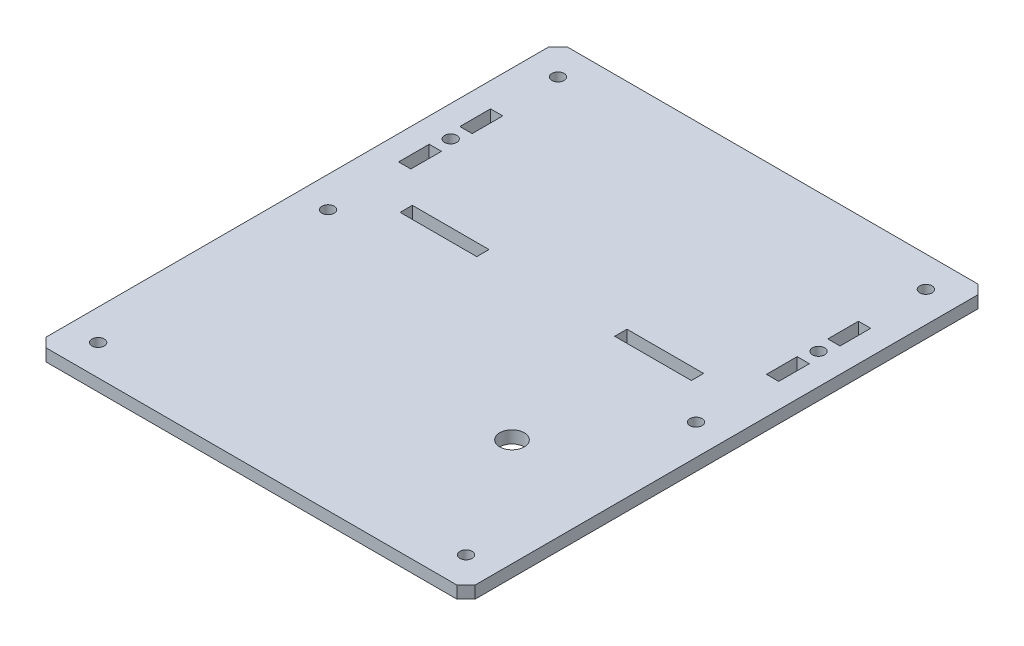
ISO-10303-21;
HEADER;
FILE_DESCRIPTION(('STEP AP214'),'2;1');
FILE_NAME('part.step','',(''),(''),'','','');
FILE_SCHEMA(('AUTOMOTIVE_DESIGN { 1 0 10303 214 1 1 1 1 }'));
ENDSEC;
DATA;
#1=APPLICATION_CONTEXT('core data for automotive mechanical design processes');
#2=APPLICATION_PROTOCOL_DEFINITION('international standard','automotive_design',2000,#1);
#3=PRODUCT_CONTEXT('',#1,'mechanical');
#4=PRODUCT('Part','Part','',(#3));
#5=PRODUCT_RELATED_PRODUCT_CATEGORY('part','',(#4));
#6=PRODUCT_DEFINITION_FORMATION('','',#4);
#7=PRODUCT_DEFINITION_CONTEXT('part definition',#1,'design');
#8=PRODUCT_DEFINITION('design','',#6,#7);
#9=PRODUCT_DEFINITION_SHAPE('','',#8);
#10=(LENGTH_UNIT() NAMED_UNIT(*) SI_UNIT(.MILLI.,.METRE.));
#11=(NAMED_UNIT(*) PLANE_ANGLE_UNIT() SI_UNIT($,.RADIAN.));
#12=(NAMED_UNIT(*) SI_UNIT($,.STERADIAN.) SOLID_ANGLE_UNIT());
#13=UNCERTAINTY_MEASURE_WITH_UNIT(LENGTH_MEASURE(1.E-05),#10,'distance_accuracy_value','');
#14=(GEOMETRIC_REPRESENTATION_CONTEXT(3) GLOBAL_UNCERTAINTY_ASSIGNED_CONTEXT((#13)) GLOBAL_UNIT_ASSIGNED_CONTEXT((#10,
#11,#12)) REPRESENTATION_CONTEXT('',''));
#15=CARTESIAN_POINT('',(0.,0.,0.));
#16=DIRECTION('',(0.,0.,1.));
#17=DIRECTION('',(1.,0.,0.));
#18=AXIS2_PLACEMENT_3D('',#15,#16,#17);
#19=CARTESIAN_POINT('',(-70.,-4.,82.));
#20=DIRECTION('',(-1.,0.,0.));
#21=DIRECTION('',(0.,0.,1.));
#22=AXIS2_PLACEMENT_3D('',#19,#20,#21);
#23=PLANE('',#22);
#24=DIRECTION('',(0.,0.,1.));
#25=VECTOR('',#24,1.);
#26=CARTESIAN_POINT('',(-70.,0.,82.));
#27=LINE('',#26,#25);
#28=CARTESIAN_POINT('',(-70.,0.,-82.));
#29=VERTEX_POINT('',#28);
#30=CARTESIAN_POINT('',(-70.,0.,82.));
#31=VERTEX_POINT('',#30);
#32=EDGE_CURVE('E435',#29,#31,#27,.T.);
#33=ORIENTED_EDGE('',*,*,#32,.F.);
#34=DIRECTION('',(0.,1.,0.));
#35=VECTOR('',#34,1.);
#36=CARTESIAN_POINT('',(-70.,-4.,-82.));
#37=LINE('',#36,#35);
#38=CARTESIAN_POINT('',(-70.,-4.,-82.));
#39=VERTEX_POINT('',#38);
#40=EDGE_CURVE('E459',#39,#29,#37,.T.);
#41=ORIENTED_EDGE('',*,*,#40,.F.);
#42=DIRECTION('',(0.,0.,1.));
#43=VECTOR('',#42,1.);
#44=CARTESIAN_POINT('',(-70.,-4.,82.));
#45=LINE('',#44,#43);
#46=CARTESIAN_POINT('',(-70.,-4.,82.));
#47=VERTEX_POINT('',#46);
#48=EDGE_CURVE('E409',#39,#47,#45,.T.);
#49=ORIENTED_EDGE('',*,*,#48,.T.);
#50=DIRECTION('',(0.,1.,0.));
#51=VECTOR('',#50,1.);
#52=CARTESIAN_POINT('',(-70.,-4.,82.));
#53=LINE('',#52,#51);
#54=EDGE_CURVE('E434',#47,#31,#53,.T.);
#55=ORIENTED_EDGE('',*,*,#54,.T.);
#56=EDGE_LOOP('',(#33,#41,#49,#55));
#57=FACE_BOUND('',#56,.T.);
#58=ADVANCED_FACE('F40',(#57),#23,.T.);
#59=CARTESIAN_POINT('',(-70.,-4.,-82.));
#60=DIRECTION('',(-0.707106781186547,0.,-0.707106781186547));
#61=DIRECTION('',(-0.707106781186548,0.,0.707106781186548));
#62=AXIS2_PLACEMENT_3D('',#59,#60,#61);
#63=PLANE('',#62);
#64=DIRECTION('',(-0.707106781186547,0.,0.707106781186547));
#65=VECTOR('',#64,1.);
#66=CARTESIAN_POINT('',(-70.,0.,-82.));
#67=LINE('',#66,#65);
#68=CARTESIAN_POINT('',(-67.,0.,-85.));
#69=VERTEX_POINT('',#68);
#70=EDGE_CURVE('E413',#69,#29,#67,.T.);
#71=ORIENTED_EDGE('',*,*,#70,.F.);
#72=DIRECTION('',(0.,1.,0.));
#73=VECTOR('',#72,1.);
#74=CARTESIAN_POINT('',(-67.,-4.,-85.));
#75=LINE('',#74,#73);
#76=CARTESIAN_POINT('',(-67.,-4.,-85.));
#77=VERTEX_POINT('',#76);
#78=EDGE_CURVE('E462',#77,#69,#75,.T.);
#79=ORIENTED_EDGE('',*,*,#78,.F.);
#80=DIRECTION('',(-0.707106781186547,0.,0.707106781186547));
#81=VECTOR('',#80,1.);
#82=CARTESIAN_POINT('',(-70.,-4.,-82.));
#83=LINE('',#82,#81);
#84=EDGE_CURVE('E431',#77,#39,#83,.T.);
#85=ORIENTED_EDGE('',*,*,#84,.T.);
#86=ORIENTED_EDGE('',*,*,#40,.T.);
#87=EDGE_LOOP('',(#71,#79,#85,#86));
#88=FACE_BOUND('',#87,.T.);
#89=ADVANCED_FACE('F587',(#88),#63,.T.);
#90=CARTESIAN_POINT('',(-67.,-4.,-85.));
#91=DIRECTION('',(0.,0.,-1.));
#92=DIRECTION('',(-1.,0.,0.));
#93=AXIS2_PLACEMENT_3D('',#90,#91,#92);
#94=PLANE('',#93);
#95=DIRECTION('',(-1.,0.,0.));
#96=VECTOR('',#95,1.);
#97=CARTESIAN_POINT('',(-67.,0.,-85.));
#98=LINE('',#97,#96);
#99=CARTESIAN_POINT('',(67.,0.,-85.));
#100=VERTEX_POINT('',#99);
#101=EDGE_CURVE('E454',#100,#69,#98,.T.);
#102=ORIENTED_EDGE('',*,*,#101,.F.);
#103=DIRECTION('',(0.,1.,0.));
#104=VECTOR('',#103,1.);
#105=CARTESIAN_POINT('',(67.,-4.,-85.));
#106=LINE('',#105,#104);
#107=CARTESIAN_POINT('',(67.,-4.,-85.));
#108=VERTEX_POINT('',#107);
#109=EDGE_CURVE('E464',#108,#100,#106,.T.);
#110=ORIENTED_EDGE('',*,*,#109,.F.);
#111=DIRECTION('',(-1.,0.,0.));
#112=VECTOR('',#111,1.);
#113=CARTESIAN_POINT('',(-67.,-4.,-85.));
#114=LINE('',#113,#112);
#115=EDGE_CURVE('E428',#108,#77,#114,.T.);
#116=ORIENTED_EDGE('',*,*,#115,.T.);
#117=ORIENTED_EDGE('',*,*,#78,.T.);
#118=EDGE_LOOP('',(#102,#110,#116,#117));
#119=FACE_BOUND('',#118,.T.);
#120=ADVANCED_FACE('F592',(#119),#94,.T.);
#121=CARTESIAN_POINT('',(67.,-4.,-85.));
#122=DIRECTION('',(0.707106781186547,0.,-0.707106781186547));
#123=DIRECTION('',(-0.707106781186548,0.,-0.707106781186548));
#124=AXIS2_PLACEMENT_3D('',#121,#122,#123);
#125=PLANE('',#124);
#126=DIRECTION('',(-0.707106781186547,0.,-0.707106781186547));
#127=VECTOR('',#126,1.);
#128=CARTESIAN_POINT('',(67.,0.,-85.));
#129=LINE('',#128,#127);
#130=CARTESIAN_POINT('',(70.,0.,-82.));
#131=VERTEX_POINT('',#130);
#132=EDGE_CURVE('E451',#131,#100,#129,.T.);
#133=ORIENTED_EDGE('',*,*,#132,.F.);
#134=DIRECTION('',(0.,1.,0.));
#135=VECTOR('',#134,1.);
#136=CARTESIAN_POINT('',(70.,-4.,-82.));
#137=LINE('',#136,#135);
#138=CARTESIAN_POINT('',(70.,-4.,-82.));
#139=VERTEX_POINT('',#138);
#140=EDGE_CURVE('E466',#139,#131,#137,.T.);
#141=ORIENTED_EDGE('',*,*,#140,.F.);
#142=DIRECTION('',(-0.707106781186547,0.,-0.707106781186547));
#143=VECTOR('',#142,1.);
#144=CARTESIAN_POINT('',(67.,-4.,-85.));
#145=LINE('',#144,#143);
#146=EDGE_CURVE('E425',#139,#108,#145,.T.);
#147=ORIENTED_EDGE('',*,*,#146,.T.);
#148=ORIENTED_EDGE('',*,*,#109,.T.);
#149=EDGE_LOOP('',(#133,#141,#147,#148));
#150=FACE_BOUND('',#149,.T.);
#151=ADVANCED_FACE('F622',(#150),#125,.T.);
#152=CARTESIAN_POINT('',(70.,-4.,82.));
#153=DIRECTION('',(1.,0.,0.));
#154=DIRECTION('',(0.,0.,-1.));
#155=AXIS2_PLACEMENT_3D('',#152,#153,#154);
#156=PLANE('',#155);
#157=DIRECTION('',(0.,0.,-1.));
#158=VECTOR('',#157,1.);
#159=CARTESIAN_POINT('',(70.,0.,82.));
#160=LINE('',#159,#158);
#161=CARTESIAN_POINT('',(70.,0.,82.));
#162=VERTEX_POINT('',#161);
#163=EDGE_CURVE('E448',#162,#131,#160,.T.);
#164=ORIENTED_EDGE('',*,*,#163,.F.);
#165=DIRECTION('',(0.,1.,0.));
#166=VECTOR('',#165,1.);
#167=CARTESIAN_POINT('',(70.,-4.,82.));
#168=LINE('',#167,#166);
#169=CARTESIAN_POINT('',(70.,-4.,82.));
#170=VERTEX_POINT('',#169);
#171=EDGE_CURVE('E468',#170,#162,#168,.T.);
#172=ORIENTED_EDGE('',*,*,#171,.F.);
#173=DIRECTION('',(0.,0.,-1.));
#174=VECTOR('',#173,1.);
#175=CARTESIAN_POINT('',(70.,-4.,82.));
#176=LINE('',#175,#174);
#177=EDGE_CURVE('E422',#170,#139,#176,.T.);
#178=ORIENTED_EDGE('',*,*,#177,.T.);
#179=ORIENTED_EDGE('',*,*,#140,.T.);
#180=EDGE_LOOP('',(#164,#172,#178,#179));
#181=FACE_BOUND('',#180,.T.);
#182=ADVANCED_FACE('F619',(#181),#156,.T.);
#183=CARTESIAN_POINT('',(67.,-4.,85.));
#184=DIRECTION('',(0.707106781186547,0.,0.707106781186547));
#185=DIRECTION('',(0.707106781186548,0.,-0.707106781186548));
#186=AXIS2_PLACEMENT_3D('',#183,#184,#185);
#187=PLANE('',#186);
#188=DIRECTION('',(0.707106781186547,0.,-0.707106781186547));
#189=VECTOR('',#188,1.);
#190=CARTESIAN_POINT('',(67.,0.,85.));
#191=LINE('',#190,#189);
#192=CARTESIAN_POINT('',(67.,0.,85.));
#193=VERTEX_POINT('',#192);
#194=EDGE_CURVE('E445',#193,#162,#191,.T.);
#195=ORIENTED_EDGE('',*,*,#194,.F.);
#196=DIRECTION('',(0.,1.,0.));
#197=VECTOR('',#196,1.);
#198=CARTESIAN_POINT('',(67.,-4.,85.));
#199=LINE('',#198,#197);
#200=CARTESIAN_POINT('',(67.,-4.,85.));
#201=VERTEX_POINT('',#200);
#202=EDGE_CURVE('E470',#201,#193,#199,.T.);
#203=ORIENTED_EDGE('',*,*,#202,.F.);
#204=DIRECTION('',(0.707106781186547,0.,-0.707106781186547));
#205=VECTOR('',#204,1.);
#206=CARTESIAN_POINT('',(67.,-4.,85.));
#207=LINE('',#206,#205);
#208=EDGE_CURVE('E419',#201,#170,#207,.T.);
#209=ORIENTED_EDGE('',*,*,#208,.T.);
#210=ORIENTED_EDGE('',*,*,#171,.T.);
#211=EDGE_LOOP('',(#195,#203,#209,#210));
#212=FACE_BOUND('',#211,.T.);
#213=ADVANCED_FACE('F615',(#212),#187,.T.);
#214=CARTESIAN_POINT('',(-67.,-4.,85.));
#215=DIRECTION('',(0.,0.,1.));
#216=DIRECTION('',(1.,0.,0.));
#217=AXIS2_PLACEMENT_3D('',#214,#215,#216);
#218=PLANE('',#217);
#219=DIRECTION('',(1.,0.,0.));
#220=VECTOR('',#219,1.);
#221=CARTESIAN_POINT('',(-67.,0.,85.));
#222=LINE('',#221,#220);
#223=CARTESIAN_POINT('',(-67.,0.,85.));
#224=VERTEX_POINT('',#223);
#225=EDGE_CURVE('E442',#224,#193,#222,.T.);
#226=ORIENTED_EDGE('',*,*,#225,.F.);
#227=DIRECTION('',(0.,1.,0.));
#228=VECTOR('',#227,1.);
#229=CARTESIAN_POINT('',(-67.,-4.,85.));
#230=LINE('',#229,#228);
#231=CARTESIAN_POINT('',(-67.,-4.,85.));
#232=VERTEX_POINT('',#231);
#233=EDGE_CURVE('E472',#232,#224,#230,.T.);
#234=ORIENTED_EDGE('',*,*,#233,.F.);
#235=DIRECTION('',(1.,0.,0.));
#236=VECTOR('',#235,1.);
#237=CARTESIAN_POINT('',(-67.,-4.,85.));
#238=LINE('',#237,#236);
#239=EDGE_CURVE('E416',#232,#201,#238,.T.);
#240=ORIENTED_EDGE('',*,*,#239,.T.);
#241=ORIENTED_EDGE('',*,*,#202,.T.);
#242=EDGE_LOOP('',(#226,#234,#240,#241));
#243=FACE_BOUND('',#242,.T.);
#244=ADVANCED_FACE('F613',(#243),#218,.T.);
#245=CARTESIAN_POINT('',(-70.,-4.,82.));
#246=DIRECTION('',(-0.707106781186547,0.,0.707106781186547));
#247=DIRECTION('',(0.707106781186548,0.,0.707106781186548));
#248=AXIS2_PLACEMENT_3D('',#245,#246,#247);
#249=PLANE('',#248);
#250=DIRECTION('',(0.707106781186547,0.,0.707106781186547));
#251=VECTOR('',#250,1.);
#252=CARTESIAN_POINT('',(-70.,0.,82.));
#253=LINE('',#252,#251);
#254=EDGE_CURVE('E438',#31,#224,#253,.T.);
#255=ORIENTED_EDGE('',*,*,#254,.F.);
#256=ORIENTED_EDGE('',*,*,#54,.F.);
#257=DIRECTION('',(0.707106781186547,0.,0.707106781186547));
#258=VECTOR('',#257,1.);
#259=CARTESIAN_POINT('',(-70.,-4.,82.));
#260=LINE('',#259,#258);
#261=EDGE_CURVE('E412',#47,#232,#260,.T.);
#262=ORIENTED_EDGE('',*,*,#261,.T.);
#263=ORIENTED_EDGE('',*,*,#233,.T.);
#264=EDGE_LOOP('',(#255,#256,#262,#263));
#265=FACE_BOUND('',#264,.T.);
#266=ADVANCED_FACE('F609',(#265),#249,.T.);
#267=CARTESIAN_POINT('',(0.,-4.,0.));
#268=DIRECTION('',(0.,-1.,0.));
#269=DIRECTION('',(0.,0.,-1.));
#270=AXIS2_PLACEMENT_3D('',#267,#268,#269);
#271=PLANE('',#270);
#272=DIRECTION('',(0.,0.,-1.));
#273=VECTOR('',#272,1.);
#274=CARTESIAN_POINT('',(61.9999999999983,-4.,-55.));
#275=LINE('',#274,#273);
#276=CARTESIAN_POINT('',(61.9999999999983,-4.,-45.));
#277=VERTEX_POINT('',#276);
#278=CARTESIAN_POINT('',(61.9999999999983,-4.,-55.));
#279=VERTEX_POINT('',#278);
#280=EDGE_CURVE('E327',#277,#279,#275,.T.);
#281=ORIENTED_EDGE('',*,*,#280,.T.);
#282=DIRECTION('',(-1.,0.,0.));
#283=VECTOR('',#282,1.);
#284=CARTESIAN_POINT('',(61.9999999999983,-4.,-55.));
#285=LINE('',#284,#283);
#286=CARTESIAN_POINT('',(57.9999999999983,-4.,-55.));
#287=VERTEX_POINT('',#286);
#288=EDGE_CURVE('E349',#279,#287,#285,.T.);
#289=ORIENTED_EDGE('',*,*,#288,.T.);
#290=DIRECTION('',(0.,0.,1.));
#291=VECTOR('',#290,1.);
#292=CARTESIAN_POINT('',(57.9999999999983,-4.,-55.));
#293=LINE('',#292,#291);
#294=CARTESIAN_POINT('',(57.9999999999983,-4.,-45.));
#295=VERTEX_POINT('',#294);
#296=EDGE_CURVE('E54',#287,#295,#293,.T.);
#297=ORIENTED_EDGE('',*,*,#296,.T.);
#298=DIRECTION('',(1.,0.,0.));
#299=VECTOR('',#298,1.);
#300=CARTESIAN_POINT('',(61.9999999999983,-4.,-45.));
#301=LINE('',#300,#299);
#302=EDGE_CURVE('E338',#295,#277,#301,.T.);
#303=ORIENTED_EDGE('',*,*,#302,.T.);
#304=EDGE_LOOP('',(#281,#289,#297,#303));
#305=FACE_BOUND('',#304,.T.);
#306=DIRECTION('',(0.,0.,-1.));
#307=VECTOR('',#306,1.);
#308=CARTESIAN_POINT('',(-58.,-4.,-55.));
#309=LINE('',#308,#307);
#310=CARTESIAN_POINT('',(-58.0000000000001,-4.,-45.));
#311=VERTEX_POINT('',#310);
#312=CARTESIAN_POINT('',(-58.,-4.,-55.));
#313=VERTEX_POINT('',#312);
#314=EDGE_CURVE('E315',#311,#313,#309,.T.);
#315=ORIENTED_EDGE('',*,*,#314,.T.);
#316=DIRECTION('',(-1.,0.,0.));
#317=VECTOR('',#316,1.);
#318=CARTESIAN_POINT('',(-62.0000000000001,-4.,-55.));
#319=LINE('',#318,#317);
#320=CARTESIAN_POINT('',(-62.0000000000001,-4.,-55.));
#321=VERTEX_POINT('',#320);
#322=EDGE_CURVE('E331',#313,#321,#319,.T.);
#323=ORIENTED_EDGE('',*,*,#322,.T.);
#324=DIRECTION('',(0.,0.,1.));
#325=VECTOR('',#324,1.);
#326=CARTESIAN_POINT('',(-62.0000000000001,-4.,-55.));
#327=LINE('',#326,#325);
#328=CARTESIAN_POINT('',(-62.0000000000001,-4.,-45.));
#329=VERTEX_POINT('',#328);
#330=EDGE_CURVE('E62',#321,#329,#327,.T.);
#331=ORIENTED_EDGE('',*,*,#330,.T.);
#332=DIRECTION('',(1.,0.,0.));
#333=VECTOR('',#332,1.);
#334=CARTESIAN_POINT('',(-62.0000000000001,-4.,-45.));
#335=LINE('',#334,#333);
#336=EDGE_CURVE('E318',#329,#311,#335,.T.);
#337=ORIENTED_EDGE('',*,*,#336,.T.);
#338=EDGE_LOOP('',(#315,#323,#331,#337));
#339=FACE_BOUND('',#338,.T.);
#340=CARTESIAN_POINT('',(-59.9999999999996,-4.,-40.0000000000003));
#341=DIRECTION('',(0.,1.,0.));
#342=DIRECTION('',(0.,0.,1.));
#343=AXIS2_PLACEMENT_3D('',#340,#341,#342);
#344=CIRCLE('',#343,1.99999999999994);
#345=CARTESIAN_POINT('',(-59.9999999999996,-4.,-38.0000000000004));
#346=VERTEX_POINT('',#345);
#347=EDGE_CURVE('E312',#346,#346,#344,.T.);
#348=ORIENTED_EDGE('',*,*,#347,.T.);
#349=EDGE_LOOP('',(#348));
#350=FACE_BOUND('',#349,.T.);
#351=CARTESIAN_POINT('',(-59.9999999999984,-4.,75.));
#352=DIRECTION('',(0.,1.,0.));
#353=DIRECTION('',(0.,0.,1.));
#354=AXIS2_PLACEMENT_3D('',#351,#352,#353);
#355=CIRCLE('',#354,2.);
#356=CARTESIAN_POINT('',(-59.9999999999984,-4.,77.));
#357=VERTEX_POINT('',#356);
#358=EDGE_CURVE('E308',#357,#357,#355,.T.);
#359=ORIENTED_EDGE('',*,*,#358,.T.);
#360=EDGE_LOOP('',(#359));
#361=FACE_BOUND('',#360,.T.);
#362=DIRECTION('',(0.,0.,-1.));
#363=VECTOR('',#362,1.);
#364=CARTESIAN_POINT('',(-58.,-4.,-35.));
#365=LINE('',#364,#363);
#366=CARTESIAN_POINT('',(-58.,-4.,-25.));
#367=VERTEX_POINT('',#366);
#368=CARTESIAN_POINT('',(-58.,-4.,-35.));
#369=VERTEX_POINT('',#368);
#370=EDGE_CURVE('E380',#367,#369,#365,.T.);
#371=ORIENTED_EDGE('',*,*,#370,.T.);
#372=DIRECTION('',(-1.,0.,0.));
#373=VECTOR('',#372,1.);
#374=CARTESIAN_POINT('',(-62.,-4.,-35.));
#375=LINE('',#374,#373);
#376=CARTESIAN_POINT('',(-62.,-4.,-35.));
#377=VERTEX_POINT('',#376);
#378=EDGE_CURVE('E377',#369,#377,#375,.T.);
#379=ORIENTED_EDGE('',*,*,#378,.T.);
#380=DIRECTION('',(0.,0.,1.));
#381=VECTOR('',#380,1.);
#382=CARTESIAN_POINT('',(-62.,-4.,-35.));
#383=LINE('',#382,#381);
#384=CARTESIAN_POINT('',(-62.,-4.,-25.));
#385=VERTEX_POINT('',#384);
#386=EDGE_CURVE('E374',#377,#385,#383,.T.);
#387=ORIENTED_EDGE('',*,*,#386,.T.);
#388=DIRECTION('',(1.,0.,0.));
#389=VECTOR('',#388,1.);
#390=CARTESIAN_POINT('',(-62.,-4.,-25.));
#391=LINE('',#390,#389);
#392=EDGE_CURVE('E362',#385,#367,#391,.T.);
#393=ORIENTED_EDGE('',*,*,#392,.T.);
#394=EDGE_LOOP('',(#371,#379,#387,#393));
#395=FACE_BOUND('',#394,.T.);
#396=CARTESIAN_POINT('',(34.9999999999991,-4.,35.));
#397=DIRECTION('',(0.,1.,0.));
#398=DIRECTION('',(0.,0.,1.));
#399=AXIS2_PLACEMENT_3D('',#396,#397,#398);
#400=CIRCLE('',#399,4.00000000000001);
#401=CARTESIAN_POINT('',(34.9999999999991,-4.,39.));
#402=VERTEX_POINT('',#401);
#403=EDGE_CURVE('E357',#402,#402,#400,.T.);
#404=ORIENTED_EDGE('',*,*,#403,.T.);
#405=EDGE_LOOP('',(#404));
#406=FACE_BOUND('',#405,.T.);
#407=CARTESIAN_POINT('',(-60.,-4.,-75.));
#408=DIRECTION('',(0.,1.,0.));
#409=DIRECTION('',(0.,0.,1.));
#410=AXIS2_PLACEMENT_3D('',#407,#408,#409);
#411=CIRCLE('',#410,2.);
#412=CARTESIAN_POINT('',(-60.,-4.,-73.));
#413=VERTEX_POINT('',#412);
#414=EDGE_CURVE('E354',#413,#413,#411,.T.);
#415=ORIENTED_EDGE('',*,*,#414,.T.);
#416=EDGE_LOOP('',(#415));
#417=FACE_BOUND('',#416,.T.);
#418=CARTESIAN_POINT('',(-59.9999999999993,-4.,0.));
#419=DIRECTION('',(0.,1.,0.));
#420=DIRECTION('',(0.,0.,1.));
#421=AXIS2_PLACEMENT_3D('',#418,#419,#420);
#422=CIRCLE('',#421,2.);
#423=CARTESIAN_POINT('',(-59.9999999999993,-4.,2.));
#424=VERTEX_POINT('',#423);
#425=EDGE_CURVE('E311',#424,#424,#422,.T.);
#426=ORIENTED_EDGE('',*,*,#425,.T.);
#427=EDGE_LOOP('',(#426));
#428=FACE_BOUND('',#427,.T.);
#429=CARTESIAN_POINT('',(59.9999999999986,-4.,-75.0000000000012));
#430=DIRECTION('',(0.,1.,0.));
#431=DIRECTION('',(0.,0.,-1.));
#432=AXIS2_PLACEMENT_3D('',#429,#430,#431);
#433=CIRCLE('',#432,2.);
#434=CARTESIAN_POINT('',(59.9999999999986,-4.,-77.0000000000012));
#435=VERTEX_POINT('',#434);
#436=EDGE_CURVE('E1027',#435,#435,#433,.T.);
#437=ORIENTED_EDGE('',*,*,#436,.T.);
#438=EDGE_LOOP('',(#437));
#439=FACE_BOUND('',#438,.T.);
#440=CARTESIAN_POINT('',(59.9999999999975,-4.,0.));
#441=DIRECTION('',(0.,1.,0.));
#442=DIRECTION('',(0.,0.,-1.));
#443=AXIS2_PLACEMENT_3D('',#440,#441,#442);
#444=CIRCLE('',#443,1.99999999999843);
#445=CARTESIAN_POINT('',(59.9999999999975,-4.,-1.99999999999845));
#446=VERTEX_POINT('',#445);
#447=EDGE_CURVE('E1024',#446,#446,#444,.T.);
#448=ORIENTED_EDGE('',*,*,#447,.T.);
#449=EDGE_LOOP('',(#448));
#450=FACE_BOUND('',#449,.T.);
#451=DIRECTION('',(0.,0.,-1.));
#452=VECTOR('',#451,1.);
#453=CARTESIAN_POINT('',(61.9999999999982,-4.,-35.));
#454=LINE('',#453,#452);
#455=CARTESIAN_POINT('',(61.9999999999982,-4.,-25.));
#456=VERTEX_POINT('',#455);
#457=CARTESIAN_POINT('',(61.9999999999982,-4.,-35.));
#458=VERTEX_POINT('',#457);
#459=EDGE_CURVE('E266',#456,#458,#454,.T.);
#460=ORIENTED_EDGE('',*,*,#459,.T.);
#461=DIRECTION('',(-1.,0.,0.));
#462=VECTOR('',#461,1.);
#463=CARTESIAN_POINT('',(61.9999999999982,-4.,-35.));
#464=LINE('',#463,#462);
#465=CARTESIAN_POINT('',(57.9999999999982,-4.,-35.));
#466=VERTEX_POINT('',#465);
#467=EDGE_CURVE('E273',#458,#466,#464,.T.);
#468=ORIENTED_EDGE('',*,*,#467,.T.);
#469=DIRECTION('',(0.,0.,1.));
#470=VECTOR('',#469,1.);
#471=CARTESIAN_POINT('',(57.9999999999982,-4.,-35.));
#472=LINE('',#471,#470);
#473=CARTESIAN_POINT('',(57.9999999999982,-4.,-25.));
#474=VERTEX_POINT('',#473);
#475=EDGE_CURVE('E277',#466,#474,#472,.T.);
#476=ORIENTED_EDGE('',*,*,#475,.T.);
#477=DIRECTION('',(1.,0.,0.));
#478=VECTOR('',#477,1.);
#479=CARTESIAN_POINT('',(61.9999999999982,-4.,-25.));
#480=LINE('',#479,#478);
#481=EDGE_CURVE('E255',#474,#456,#480,.T.);
#482=ORIENTED_EDGE('',*,*,#481,.T.);
#483=EDGE_LOOP('',(#460,#468,#476,#482));
#484=FACE_BOUND('',#483,.T.);
#485=DIRECTION('',(0.,0.,-1.));
#486=VECTOR('',#485,1.);
#487=CARTESIAN_POINT('',(47.4999999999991,-4.,-15.));
#488=LINE('',#487,#486);
#489=CARTESIAN_POINT('',(47.4999999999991,-4.,-11.));
#490=VERTEX_POINT('',#489);
#491=CARTESIAN_POINT('',(47.4999999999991,-4.,-15.));
#492=VERTEX_POINT('',#491);
#493=EDGE_CURVE('E263',#490,#492,#488,.T.);
#494=ORIENTED_EDGE('',*,*,#493,.T.);
#495=DIRECTION('',(-1.,0.,0.));
#496=VECTOR('',#495,1.);
#497=CARTESIAN_POINT('',(47.4999999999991,-4.,-15.));
#498=LINE('',#497,#496);
#499=CARTESIAN_POINT('',(22.4999999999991,-4.,-15.));
#500=VERTEX_POINT('',#499);
#501=EDGE_CURVE('E303',#492,#500,#498,.T.);
#502=ORIENTED_EDGE('',*,*,#501,.T.);
#503=DIRECTION('',(0.,0.,1.));
#504=VECTOR('',#503,1.);
#505=CARTESIAN_POINT('',(22.4999999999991,-4.,-15.));
#506=LINE('',#505,#504);
#507=CARTESIAN_POINT('',(22.4999999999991,-4.,-11.));
#508=VERTEX_POINT('',#507);
#509=EDGE_CURVE('E300',#500,#508,#506,.T.);
#510=ORIENTED_EDGE('',*,*,#509,.T.);
#511=DIRECTION('',(1.,0.,0.));
#512=VECTOR('',#511,1.);
#513=CARTESIAN_POINT('',(47.4999999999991,-4.,-11.));
#514=LINE('',#513,#512);
#515=EDGE_CURVE('E287',#508,#490,#514,.T.);
#516=ORIENTED_EDGE('',*,*,#515,.T.);
#517=EDGE_LOOP('',(#494,#502,#510,#516));
#518=FACE_BOUND('',#517,.T.);
#519=CARTESIAN_POINT('',(59.9999999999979,-4.,-40.0000000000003));
#520=DIRECTION('',(0.,1.,0.));
#521=DIRECTION('',(0.,0.,-1.));
#522=AXIS2_PLACEMENT_3D('',#519,#520,#521);
#523=CIRCLE('',#522,1.99999999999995);
#524=CARTESIAN_POINT('',(59.9999999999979,-4.,-42.0000000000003));
#525=VERTEX_POINT('',#524);
#526=EDGE_CURVE('E297',#525,#525,#523,.T.);
#527=ORIENTED_EDGE('',*,*,#526,.T.);
#528=EDGE_LOOP('',(#527));
#529=FACE_BOUND('',#528,.T.);
#530=CARTESIAN_POINT('',(59.9999999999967,-4.,75.));
#531=DIRECTION('',(0.,1.,0.));
#532=DIRECTION('',(0.,0.,-1.));
#533=AXIS2_PLACEMENT_3D('',#530,#531,#532);
#534=CIRCLE('',#533,1.99999999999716);
#535=CARTESIAN_POINT('',(59.9999999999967,-4.,73.0000000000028));
#536=VERTEX_POINT('',#535);
#537=EDGE_CURVE('E1026',#536,#536,#534,.T.);
#538=ORIENTED_EDGE('',*,*,#537,.T.);
#539=EDGE_LOOP('',(#538));
#540=FACE_BOUND('',#539,.T.);
#541=DIRECTION('',(0.,0.,-1.));
#542=VECTOR('',#541,1.);
#543=CARTESIAN_POINT('',(-22.5000000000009,-4.,-15.));
#544=LINE('',#543,#542);
#545=CARTESIAN_POINT('',(-22.5000000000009,-4.,-11.));
#546=VERTEX_POINT('',#545);
#547=CARTESIAN_POINT('',(-22.5000000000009,-4.,-15.));
#548=VERTEX_POINT('',#547);
#549=EDGE_CURVE('E383',#546,#548,#544,.T.);
#550=ORIENTED_EDGE('',*,*,#549,.T.);
#551=DIRECTION('',(-1.,0.,0.));
#552=VECTOR('',#551,1.);
#553=CARTESIAN_POINT('',(-47.5000000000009,-4.,-15.));
#554=LINE('',#553,#552);
#555=CARTESIAN_POINT('',(-47.5000000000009,-4.,-15.));
#556=VERTEX_POINT('',#555);
#557=EDGE_CURVE('E388',#548,#556,#554,.T.);
#558=ORIENTED_EDGE('',*,*,#557,.T.);
#559=DIRECTION('',(0.,0.,1.));
#560=VECTOR('',#559,1.);
#561=CARTESIAN_POINT('',(-47.5000000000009,-4.,-15.));
#562=LINE('',#561,#560);
#563=CARTESIAN_POINT('',(-47.5000000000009,-4.,-11.));
#564=VERTEX_POINT('',#563);
#565=EDGE_CURVE('E391',#556,#564,#562,.T.);
#566=ORIENTED_EDGE('',*,*,#565,.T.);
#567=DIRECTION('',(1.,0.,0.));
#568=VECTOR('',#567,1.);
#569=CARTESIAN_POINT('',(-47.5000000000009,-4.,-11.));
#570=LINE('',#569,#568);
#571=EDGE_CURVE('E394',#564,#546,#570,.T.);
#572=ORIENTED_EDGE('',*,*,#571,.T.);
#573=EDGE_LOOP('',(#550,#558,#566,#572));
#574=FACE_BOUND('',#573,.T.);
#575=ORIENTED_EDGE('',*,*,#48,.F.);
#576=ORIENTED_EDGE('',*,*,#84,.F.);
#577=ORIENTED_EDGE('',*,*,#115,.F.);
#578=ORIENTED_EDGE('',*,*,#146,.F.);
#579=ORIENTED_EDGE('',*,*,#177,.F.);
#580=ORIENTED_EDGE('',*,*,#208,.F.);
#581=ORIENTED_EDGE('',*,*,#239,.F.);
#582=ORIENTED_EDGE('',*,*,#261,.F.);
#583=EDGE_LOOP('',(#575,#576,#577,#578,#579,#580,#581,#582));
#584=FACE_BOUND('',#583,.T.);
#585=ADVANCED_FACE('F275',(#305,#339,#350,#361,#395,#406,#417,#428,#439,#450,#484,#518,#529,
#540,#574,#584),#271,.T.);
#586=CARTESIAN_POINT('',(0.,0.,0.));
#587=DIRECTION('',(0.,-1.,0.));
#588=DIRECTION('',(0.,0.,-1.));
#589=AXIS2_PLACEMENT_3D('',#586,#587,#588);
#590=PLANE('',#589);
#591=DIRECTION('',(1.,0.,0.));
#592=VECTOR('',#591,1.);
#593=CARTESIAN_POINT('',(0.,0.,-55.));
#594=LINE('',#593,#592);
#595=CARTESIAN_POINT('',(57.9999999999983,0.,-55.));
#596=VERTEX_POINT('',#595);
#597=CARTESIAN_POINT('',(61.9999999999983,0.,-55.));
#598=VERTEX_POINT('',#597);
#599=EDGE_CURVE('E556',#596,#598,#594,.T.);
#600=ORIENTED_EDGE('',*,*,#599,.T.);
#601=DIRECTION('',(0.,0.,1.));
#602=VECTOR('',#601,1.);
#603=CARTESIAN_POINT('',(61.9999999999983,0.,0.));
#604=LINE('',#603,#602);
#605=CARTESIAN_POINT('',(61.9999999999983,0.,-45.));
#606=VERTEX_POINT('',#605);
#607=EDGE_CURVE('E11',#598,#606,#604,.T.);
#608=ORIENTED_EDGE('',*,*,#607,.T.);
#609=DIRECTION('',(-1.,0.,0.));
#610=VECTOR('',#609,1.);
#611=CARTESIAN_POINT('',(0.,0.,-45.));
#612=LINE('',#611,#610);
#613=CARTESIAN_POINT('',(57.9999999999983,0.,-45.));
#614=VERTEX_POINT('',#613);
#615=EDGE_CURVE('E47',#606,#614,#612,.T.);
#616=ORIENTED_EDGE('',*,*,#615,.T.);
#617=DIRECTION('',(0.,0.,-1.));
#618=VECTOR('',#617,1.);
#619=CARTESIAN_POINT('',(57.9999999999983,0.,0.));
#620=LINE('',#619,#618);
#621=EDGE_CURVE('E559',#614,#596,#620,.T.);
#622=ORIENTED_EDGE('',*,*,#621,.T.);
#623=EDGE_LOOP('',(#600,#608,#616,#622));
#624=FACE_BOUND('',#623,.T.);
#625=DIRECTION('',(1.,0.,0.));
#626=VECTOR('',#625,1.);
#627=CARTESIAN_POINT('',(0.,0.,-55.));
#628=LINE('',#627,#626);
#629=CARTESIAN_POINT('',(-62.0000000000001,0.,-55.));
#630=VERTEX_POINT('',#629);
#631=CARTESIAN_POINT('',(-58.,0.,-55.));
#632=VERTEX_POINT('',#631);
#633=EDGE_CURVE('E540',#630,#632,#628,.T.);
#634=ORIENTED_EDGE('',*,*,#633,.T.);
#635=DIRECTION('',(0.,0.,1.));
#636=VECTOR('',#635,1.);
#637=CARTESIAN_POINT('',(-58.0000000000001,0.,0.));
#638=LINE('',#637,#636);
#639=CARTESIAN_POINT('',(-58.0000000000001,0.,-45.));
#640=VERTEX_POINT('',#639);
#641=EDGE_CURVE('E553',#632,#640,#638,.T.);
#642=ORIENTED_EDGE('',*,*,#641,.T.);
#643=DIRECTION('',(-1.,0.,0.));
#644=VECTOR('',#643,1.);
#645=CARTESIAN_POINT('',(0.,0.,-45.));
#646=LINE('',#645,#644);
#647=CARTESIAN_POINT('',(-62.0000000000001,0.,-45.));
#648=VERTEX_POINT('',#647);
#649=EDGE_CURVE('E550',#640,#648,#646,.T.);
#650=ORIENTED_EDGE('',*,*,#649,.T.);
#651=DIRECTION('',(0.,0.,-1.));
#652=VECTOR('',#651,1.);
#653=CARTESIAN_POINT('',(-62.,0.,0.));
#654=LINE('',#653,#652);
#655=EDGE_CURVE('E547',#648,#630,#654,.T.);
#656=ORIENTED_EDGE('',*,*,#655,.T.);
#657=EDGE_LOOP('',(#634,#642,#650,#656));
#658=FACE_BOUND('',#657,.T.);
#659=CARTESIAN_POINT('',(-59.9999999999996,0.,-40.0000000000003));
#660=DIRECTION('',(0.,-1.,0.));
#661=DIRECTION('',(0.,0.,-1.));
#662=AXIS2_PLACEMENT_3D('',#659,#660,#661);
#663=CIRCLE('',#662,1.99999999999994);
#664=CARTESIAN_POINT('',(-59.9999999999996,0.,-42.0000000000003));
#665=VERTEX_POINT('',#664);
#666=EDGE_CURVE('E439',#665,#665,#663,.T.);
#667=ORIENTED_EDGE('',*,*,#666,.T.);
#668=EDGE_LOOP('',(#667));
#669=FACE_BOUND('',#668,.T.);
#670=CARTESIAN_POINT('',(-59.9999999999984,0.,75.));
#671=DIRECTION('',(0.,-1.,0.));
#672=DIRECTION('',(0.,0.,-1.));
#673=AXIS2_PLACEMENT_3D('',#670,#671,#672);
#674=CIRCLE('',#673,2.);
#675=CARTESIAN_POINT('',(-59.9999999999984,0.,73.));
#676=VERTEX_POINT('',#675);
#677=EDGE_CURVE('E528',#676,#676,#674,.T.);
#678=ORIENTED_EDGE('',*,*,#677,.T.);
#679=EDGE_LOOP('',(#678));
#680=FACE_BOUND('',#679,.T.);
#681=DIRECTION('',(1.,0.,0.));
#682=VECTOR('',#681,1.);
#683=CARTESIAN_POINT('',(0.,0.,-35.));
#684=LINE('',#683,#682);
#685=CARTESIAN_POINT('',(-62.,0.,-35.));
#686=VERTEX_POINT('',#685);
#687=CARTESIAN_POINT('',(-58.,0.,-35.));
#688=VERTEX_POINT('',#687);
#689=EDGE_CURVE('E513',#686,#688,#684,.T.);
#690=ORIENTED_EDGE('',*,*,#689,.T.);
#691=DIRECTION('',(0.,0.,1.));
#692=VECTOR('',#691,1.);
#693=CARTESIAN_POINT('',(-58.,0.,0.));
#694=LINE('',#693,#692);
#695=CARTESIAN_POINT('',(-58.,0.,-25.));
#696=VERTEX_POINT('',#695);
#697=EDGE_CURVE('E537',#688,#696,#694,.T.);
#698=ORIENTED_EDGE('',*,*,#697,.T.);
#699=DIRECTION('',(-1.,0.,0.));
#700=VECTOR('',#699,1.);
#701=CARTESIAN_POINT('',(0.,0.,-25.));
#702=LINE('',#701,#700);
#703=CARTESIAN_POINT('',(-62.,0.,-25.));
#704=VERTEX_POINT('',#703);
#705=EDGE_CURVE('E534',#696,#704,#702,.T.);
#706=ORIENTED_EDGE('',*,*,#705,.T.);
#707=DIRECTION('',(0.,0.,-1.));
#708=VECTOR('',#707,1.);
#709=CARTESIAN_POINT('',(-62.,0.,0.));
#710=LINE('',#709,#708);
#711=EDGE_CURVE('E531',#704,#686,#710,.T.);
#712=ORIENTED_EDGE('',*,*,#711,.T.);
#713=EDGE_LOOP('',(#690,#698,#706,#712));
#714=FACE_BOUND('',#713,.T.);
#715=CARTESIAN_POINT('',(34.9999999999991,0.,35.));
#716=DIRECTION('',(0.,-1.,0.));
#717=DIRECTION('',(0.,0.,-1.));
#718=AXIS2_PLACEMENT_3D('',#715,#716,#717);
#719=CIRCLE('',#718,4.00000000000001);
#720=CARTESIAN_POINT('',(34.9999999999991,0.,31.));
#721=VERTEX_POINT('',#720);
#722=EDGE_CURVE('E525',#721,#721,#719,.T.);
#723=ORIENTED_EDGE('',*,*,#722,.T.);
#724=EDGE_LOOP('',(#723));
#725=FACE_BOUND('',#724,.T.);
#726=CARTESIAN_POINT('',(-60.,0.,-75.));
#727=DIRECTION('',(0.,-1.,0.));
#728=DIRECTION('',(0.,0.,-1.));
#729=AXIS2_PLACEMENT_3D('',#726,#727,#728);
#730=CIRCLE('',#729,2.);
#731=CARTESIAN_POINT('',(-60.,0.,-77.));
#732=VERTEX_POINT('',#731);
#733=EDGE_CURVE('E522',#732,#732,#730,.T.);
#734=ORIENTED_EDGE('',*,*,#733,.T.);
#735=EDGE_LOOP('',(#734));
#736=FACE_BOUND('',#735,.T.);
#737=CARTESIAN_POINT('',(-59.9999999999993,0.,0.));
#738=DIRECTION('',(0.,-1.,0.));
#739=DIRECTION('',(0.,0.,-1.));
#740=AXIS2_PLACEMENT_3D('',#737,#738,#739);
#741=CIRCLE('',#740,2.);
#742=CARTESIAN_POINT('',(-59.9999999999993,0.,-2.));
#743=VERTEX_POINT('',#742);
#744=EDGE_CURVE('E519',#743,#743,#741,.T.);
#745=ORIENTED_EDGE('',*,*,#744,.T.);
#746=EDGE_LOOP('',(#745));
#747=FACE_BOUND('',#746,.T.);
#748=CARTESIAN_POINT('',(59.9999999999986,0.,-75.0000000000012));
#749=DIRECTION('',(0.,-1.,0.));
#750=DIRECTION('',(0.,0.,-1.));
#751=AXIS2_PLACEMENT_3D('',#748,#749,#750);
#752=CIRCLE('',#751,2.);
#753=CARTESIAN_POINT('',(59.9999999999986,0.,-77.0000000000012));
#754=VERTEX_POINT('',#753);
#755=EDGE_CURVE('E516',#754,#754,#752,.T.);
#756=ORIENTED_EDGE('',*,*,#755,.T.);
#757=EDGE_LOOP('',(#756));
#758=FACE_BOUND('',#757,.T.);
#759=CARTESIAN_POINT('',(59.9999999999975,0.,0.));
#760=DIRECTION('',(0.,-1.,0.));
#761=DIRECTION('',(0.,0.,-1.));
#762=AXIS2_PLACEMENT_3D('',#759,#760,#761);
#763=CIRCLE('',#762,1.99999999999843);
#764=CARTESIAN_POINT('',(59.9999999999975,0.,-1.99999999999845));
#765=VERTEX_POINT('',#764);
#766=EDGE_CURVE('E492',#765,#765,#763,.T.);
#767=ORIENTED_EDGE('',*,*,#766,.T.);
#768=EDGE_LOOP('',(#767));
#769=FACE_BOUND('',#768,.T.);
#770=DIRECTION('',(1.,0.,0.));
#771=VECTOR('',#770,1.);
#772=CARTESIAN_POINT('',(0.,0.,-35.));
#773=LINE('',#772,#771);
#774=CARTESIAN_POINT('',(57.9999999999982,0.,-35.));
#775=VERTEX_POINT('',#774);
#776=CARTESIAN_POINT('',(61.9999999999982,0.,-35.));
#777=VERTEX_POINT('',#776);
#778=EDGE_CURVE('E504',#775,#777,#773,.T.);
#779=ORIENTED_EDGE('',*,*,#778,.T.);
#780=DIRECTION('',(0.,0.,1.));
#781=VECTOR('',#780,1.);
#782=CARTESIAN_POINT('',(61.9999999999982,0.,0.));
#783=LINE('',#782,#781);
#784=CARTESIAN_POINT('',(61.9999999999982,0.,-25.));
#785=VERTEX_POINT('',#784);
#786=EDGE_CURVE('E511',#777,#785,#783,.T.);
#787=ORIENTED_EDGE('',*,*,#786,.T.);
#788=DIRECTION('',(-1.,0.,0.));
#789=VECTOR('',#788,1.);
#790=CARTESIAN_POINT('',(0.,0.,-25.));
#791=LINE('',#790,#789);
#792=CARTESIAN_POINT('',(57.9999999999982,0.,-25.));
#793=VERTEX_POINT('',#792);
#794=EDGE_CURVE('E258',#785,#793,#791,.T.);
#795=ORIENTED_EDGE('',*,*,#794,.T.);
#796=DIRECTION('',(0.,0.,-1.));
#797=VECTOR('',#796,1.);
#798=CARTESIAN_POINT('',(57.9999999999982,0.,0.));
#799=LINE('',#798,#797);
#800=EDGE_CURVE('E507',#793,#775,#799,.T.);
#801=ORIENTED_EDGE('',*,*,#800,.T.);
#802=EDGE_LOOP('',(#779,#787,#795,#801));
#803=FACE_BOUND('',#802,.T.);
#804=DIRECTION('',(1.,0.,0.));
#805=VECTOR('',#804,1.);
#806=CARTESIAN_POINT('',(0.,0.,-15.));
#807=LINE('',#806,#805);
#808=CARTESIAN_POINT('',(22.4999999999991,0.,-15.));
#809=VERTEX_POINT('',#808);
#810=CARTESIAN_POINT('',(47.4999999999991,0.,-15.));
#811=VERTEX_POINT('',#810);
#812=EDGE_CURVE('E486',#809,#811,#807,.T.);
#813=ORIENTED_EDGE('',*,*,#812,.T.);
#814=DIRECTION('',(0.,0.,1.));
#815=VECTOR('',#814,1.);
#816=CARTESIAN_POINT('',(47.4999999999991,0.,0.));
#817=LINE('',#816,#815);
#818=CARTESIAN_POINT('',(47.4999999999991,0.,-11.));
#819=VERTEX_POINT('',#818);
#820=EDGE_CURVE('E501',#811,#819,#817,.T.);
#821=ORIENTED_EDGE('',*,*,#820,.T.);
#822=DIRECTION('',(-1.,0.,0.));
#823=VECTOR('',#822,1.);
#824=CARTESIAN_POINT('',(0.,0.,-11.));
#825=LINE('',#824,#823);
#826=CARTESIAN_POINT('',(22.4999999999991,0.,-11.));
#827=VERTEX_POINT('',#826);
#828=EDGE_CURVE('E498',#819,#827,#825,.T.);
#829=ORIENTED_EDGE('',*,*,#828,.T.);
#830=DIRECTION('',(0.,0.,-1.));
#831=VECTOR('',#830,1.);
#832=CARTESIAN_POINT('',(22.4999999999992,0.,0.));
#833=LINE('',#832,#831);
#834=EDGE_CURVE('E495',#827,#809,#833,.T.);
#835=ORIENTED_EDGE('',*,*,#834,.T.);
#836=EDGE_LOOP('',(#813,#821,#829,#835));
#837=FACE_BOUND('',#836,.T.);
#838=CARTESIAN_POINT('',(59.9999999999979,0.,-40.0000000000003));
#839=DIRECTION('',(0.,-1.,0.));
#840=DIRECTION('',(0.,0.,-1.));
#841=AXIS2_PLACEMENT_3D('',#838,#839,#840);
#842=CIRCLE('',#841,1.99999999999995);
#843=CARTESIAN_POINT('',(59.9999999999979,0.,-42.0000000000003));
#844=VERTEX_POINT('',#843);
#845=EDGE_CURVE('E489',#844,#844,#842,.T.);
#846=ORIENTED_EDGE('',*,*,#845,.T.);
#847=EDGE_LOOP('',(#846));
#848=FACE_BOUND('',#847,.T.);
#849=CARTESIAN_POINT('',(59.9999999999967,0.,75.));
#850=DIRECTION('',(0.,-1.,0.));
#851=DIRECTION('',(0.,0.,-1.));
#852=AXIS2_PLACEMENT_3D('',#849,#850,#851);
#853=CIRCLE('',#852,1.99999999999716);
#854=CARTESIAN_POINT('',(59.9999999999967,0.,73.0000000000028));
#855=VERTEX_POINT('',#854);
#856=EDGE_CURVE('E401',#855,#855,#853,.T.);
#857=ORIENTED_EDGE('',*,*,#856,.T.);
#858=EDGE_LOOP('',(#857));
#859=FACE_BOUND('',#858,.T.);
#860=DIRECTION('',(1.,0.,0.));
#861=VECTOR('',#860,1.);
#862=CARTESIAN_POINT('',(0.,0.,-15.));
#863=LINE('',#862,#861);
#864=CARTESIAN_POINT('',(-47.5000000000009,0.,-15.));
#865=VERTEX_POINT('',#864);
#866=CARTESIAN_POINT('',(-22.5000000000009,0.,-15.));
#867=VERTEX_POINT('',#866);
#868=EDGE_CURVE('E461',#865,#867,#863,.T.);
#869=ORIENTED_EDGE('',*,*,#868,.T.);
#870=DIRECTION('',(0.,0.,1.));
#871=VECTOR('',#870,1.);
#872=CARTESIAN_POINT('',(-22.5000000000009,0.,0.));
#873=LINE('',#872,#871);
#874=CARTESIAN_POINT('',(-22.5000000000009,0.,-11.));
#875=VERTEX_POINT('',#874);
#876=EDGE_CURVE('E483',#867,#875,#873,.T.);
#877=ORIENTED_EDGE('',*,*,#876,.T.);
#878=DIRECTION('',(-1.,0.,0.));
#879=VECTOR('',#878,1.);
#880=CARTESIAN_POINT('',(0.,0.,-11.));
#881=LINE('',#880,#879);
#882=CARTESIAN_POINT('',(-47.5000000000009,0.,-11.));
#883=VERTEX_POINT('',#882);
#884=EDGE_CURVE('E480',#875,#883,#881,.T.);
#885=ORIENTED_EDGE('',*,*,#884,.T.);
#886=DIRECTION('',(0.,0.,-1.));
#887=VECTOR('',#886,1.);
#888=CARTESIAN_POINT('',(-47.5000000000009,0.,0.));
#889=LINE('',#888,#887);
#890=EDGE_CURVE('E477',#883,#865,#889,.T.);
#891=ORIENTED_EDGE('',*,*,#890,.T.);
#892=EDGE_LOOP('',(#869,#877,#885,#891));
#893=FACE_BOUND('',#892,.T.);
#894=ORIENTED_EDGE('',*,*,#32,.T.);
#895=ORIENTED_EDGE('',*,*,#254,.T.);
#896=ORIENTED_EDGE('',*,*,#225,.T.);
#897=ORIENTED_EDGE('',*,*,#194,.T.);
#898=ORIENTED_EDGE('',*,*,#163,.T.);
#899=ORIENTED_EDGE('',*,*,#132,.T.);
#900=ORIENTED_EDGE('',*,*,#101,.T.);
#901=ORIENTED_EDGE('',*,*,#70,.T.);
#902=EDGE_LOOP('',(#894,#895,#896,#897,#898,#899,#900,#901));
#903=FACE_BOUND('',#902,.T.);
#904=ADVANCED_FACE('F563',(#624,#658,#669,#680,#714,#725,#736,#747,#758,#769,#803,#837,#848,
#859,#893,#903),#590,.F.);
#905=CARTESIAN_POINT('',(-22.5000000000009,-4.,-15.));
#906=DIRECTION('',(1.,0.,0.));
#907=DIRECTION('',(0.,0.,-1.));
#908=AXIS2_PLACEMENT_3D('',#905,#906,#907);
#909=PLANE('',#908);
#910=DIRECTION('',(0.,1.,0.));
#911=VECTOR('',#910,1.);
#912=CARTESIAN_POINT('',(-22.5000000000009,-4.,-15.));
#913=LINE('',#912,#911);
#914=EDGE_CURVE('E397',#548,#867,#913,.T.);
#915=ORIENTED_EDGE('',*,*,#914,.F.);
#916=ORIENTED_EDGE('',*,*,#549,.F.);
#917=DIRECTION('',(0.,1.,0.));
#918=VECTOR('',#917,1.);
#919=CARTESIAN_POINT('',(-22.5000000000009,-4.,-11.));
#920=LINE('',#919,#918);
#921=EDGE_CURVE('E398',#546,#875,#920,.T.);
#922=ORIENTED_EDGE('',*,*,#921,.T.);
#923=ORIENTED_EDGE('',*,*,#876,.F.);
#924=EDGE_LOOP('',(#915,#916,#922,#923));
#925=FACE_BOUND('',#924,.T.);
#926=ADVANCED_FACE('F645',(#925),#909,.F.);
#927=CARTESIAN_POINT('',(-47.5000000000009,-4.,-11.));
#928=DIRECTION('',(0.,0.,1.));
#929=DIRECTION('',(1.,0.,0.));
#930=AXIS2_PLACEMENT_3D('',#927,#928,#929);
#931=PLANE('',#930);
#932=ORIENTED_EDGE('',*,*,#921,.F.);
#933=ORIENTED_EDGE('',*,*,#571,.F.);
#934=DIRECTION('',(0.,1.,0.));
#935=VECTOR('',#934,1.);
#936=CARTESIAN_POINT('',(-47.5000000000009,-4.,-11.));
#937=LINE('',#936,#935);
#938=EDGE_CURVE('E402',#564,#883,#937,.T.);
#939=ORIENTED_EDGE('',*,*,#938,.T.);
#940=ORIENTED_EDGE('',*,*,#884,.F.);
#941=EDGE_LOOP('',(#932,#933,#939,#940));
#942=FACE_BOUND('',#941,.T.);
#943=ADVANCED_FACE('F649',(#942),#931,.F.);
#944=CARTESIAN_POINT('',(-47.5000000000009,-4.,-15.));
#945=DIRECTION('',(-1.,0.,0.));
#946=DIRECTION('',(0.,0.,1.));
#947=AXIS2_PLACEMENT_3D('',#944,#945,#946);
#948=PLANE('',#947);
#949=ORIENTED_EDGE('',*,*,#938,.F.);
#950=ORIENTED_EDGE('',*,*,#565,.F.);
#951=DIRECTION('',(0.,1.,0.));
#952=VECTOR('',#951,1.);
#953=CARTESIAN_POINT('',(-47.5000000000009,-4.,-15.));
#954=LINE('',#953,#952);
#955=EDGE_CURVE('E405',#556,#865,#954,.T.);
#956=ORIENTED_EDGE('',*,*,#955,.T.);
#957=ORIENTED_EDGE('',*,*,#890,.F.);
#958=EDGE_LOOP('',(#949,#950,#956,#957));
#959=FACE_BOUND('',#958,.T.);
#960=ADVANCED_FACE('F655',(#959),#948,.F.);
#961=CARTESIAN_POINT('',(-47.5000000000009,-4.,-15.));
#962=DIRECTION('',(0.,0.,-1.));
#963=DIRECTION('',(-1.,0.,0.));
#964=AXIS2_PLACEMENT_3D('',#961,#962,#963);
#965=PLANE('',#964);
#966=ORIENTED_EDGE('',*,*,#955,.F.);
#967=ORIENTED_EDGE('',*,*,#557,.F.);
#968=ORIENTED_EDGE('',*,*,#914,.T.);
#969=ORIENTED_EDGE('',*,*,#868,.F.);
#970=EDGE_LOOP('',(#966,#967,#968,#969));
#971=FACE_BOUND('',#970,.T.);
#972=ADVANCED_FACE('F651',(#971),#965,.F.);
#973=CARTESIAN_POINT('',(59.9999999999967,-4.,75.));
#974=DIRECTION('',(0.,1.,0.));
#975=DIRECTION('',(0.,0.,1.));
#976=AXIS2_PLACEMENT_3D('',#973,#974,#975);
#977=CYLINDRICAL_SURFACE('',#976,1.99999999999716);
#978=ORIENTED_EDGE('',*,*,#537,.F.);
#979=EDGE_LOOP('',(#978));
#980=FACE_BOUND('',#979,.T.);
#981=ORIENTED_EDGE('',*,*,#856,.F.);
#982=EDGE_LOOP('',(#981));
#983=FACE_BOUND('',#982,.T.);
#984=ADVANCED_FACE('F654',(#980,#983),#977,.F.);
#985=CARTESIAN_POINT('',(59.9999999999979,-4.,-40.0000000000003));
#986=DIRECTION('',(0.,1.,0.));
#987=DIRECTION('',(0.,0.,1.));
#988=AXIS2_PLACEMENT_3D('',#985,#986,#987);
#989=CYLINDRICAL_SURFACE('',#988,1.99999999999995);
#990=ORIENTED_EDGE('',*,*,#526,.F.);
#991=EDGE_LOOP('',(#990));
#992=FACE_BOUND('',#991,.T.);
#993=ORIENTED_EDGE('',*,*,#845,.F.);
#994=EDGE_LOOP('',(#993));
#995=FACE_BOUND('',#994,.T.);
#996=ADVANCED_FACE('F719',(#992,#995),#989,.F.);
#997=CARTESIAN_POINT('',(47.4999999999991,-4.,-15.));
#998=DIRECTION('',(1.,0.,0.));
#999=DIRECTION('',(0.,0.,-1.));
#1000=AXIS2_PLACEMENT_3D('',#997,#998,#999);
#1001=PLANE('',#1000);
#1002=DIRECTION('',(0.,1.,0.));
#1003=VECTOR('',#1002,1.);
#1004=CARTESIAN_POINT('',(47.4999999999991,-4.,-15.));
#1005=LINE('',#1004,#1003);
#1006=EDGE_CURVE('E285',#492,#811,#1005,.T.);
#1007=ORIENTED_EDGE('',*,*,#1006,.F.);
#1008=ORIENTED_EDGE('',*,*,#493,.F.);
#1009=DIRECTION('',(0.,1.,0.));
#1010=VECTOR('',#1009,1.);
#1011=CARTESIAN_POINT('',(47.4999999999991,-4.,-11.));
#1012=LINE('',#1011,#1010);
#1013=EDGE_CURVE('E294',#490,#819,#1012,.T.);
#1014=ORIENTED_EDGE('',*,*,#1013,.T.);
#1015=ORIENTED_EDGE('',*,*,#820,.F.);
#1016=EDGE_LOOP('',(#1007,#1008,#1014,#1015));
#1017=FACE_BOUND('',#1016,.T.);
#1018=ADVANCED_FACE('F725',(#1017),#1001,.F.);
#1019=CARTESIAN_POINT('',(47.4999999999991,-4.,-11.));
#1020=DIRECTION('',(0.,0.,1.));
#1021=DIRECTION('',(1.,0.,0.));
#1022=AXIS2_PLACEMENT_3D('',#1019,#1020,#1021);
#1023=PLANE('',#1022);
#1024=ORIENTED_EDGE('',*,*,#1013,.F.);
#1025=ORIENTED_EDGE('',*,*,#515,.F.);
#1026=DIRECTION('',(0.,1.,0.));
#1027=VECTOR('',#1026,1.);
#1028=CARTESIAN_POINT('',(22.4999999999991,-4.,-11.));
#1029=LINE('',#1028,#1027);
#1030=EDGE_CURVE('E291',#508,#827,#1029,.T.);
#1031=ORIENTED_EDGE('',*,*,#1030,.T.);
#1032=ORIENTED_EDGE('',*,*,#828,.F.);
#1033=EDGE_LOOP('',(#1024,#1025,#1031,#1032));
#1034=FACE_BOUND('',#1033,.T.);
#1035=ADVANCED_FACE('F747',(#1034),#1023,.F.);
#1036=CARTESIAN_POINT('',(22.4999999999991,-4.,-15.));
#1037=DIRECTION('',(-1.,0.,0.));
#1038=DIRECTION('',(0.,0.,1.));
#1039=AXIS2_PLACEMENT_3D('',#1036,#1037,#1038);
#1040=PLANE('',#1039);
#1041=ORIENTED_EDGE('',*,*,#1030,.F.);
#1042=ORIENTED_EDGE('',*,*,#509,.F.);
#1043=DIRECTION('',(0.,1.,0.));
#1044=VECTOR('',#1043,1.);
#1045=CARTESIAN_POINT('',(22.4999999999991,-4.,-15.));
#1046=LINE('',#1045,#1044);
#1047=EDGE_CURVE('E288',#500,#809,#1046,.T.);
#1048=ORIENTED_EDGE('',*,*,#1047,.T.);
#1049=ORIENTED_EDGE('',*,*,#834,.F.);
#1050=EDGE_LOOP('',(#1041,#1042,#1048,#1049));
#1051=FACE_BOUND('',#1050,.T.);
#1052=ADVANCED_FACE('F751',(#1051),#1040,.F.);
#1053=CARTESIAN_POINT('',(47.4999999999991,-4.,-15.));
#1054=DIRECTION('',(0.,0.,-1.));
#1055=DIRECTION('',(-1.,0.,0.));
#1056=AXIS2_PLACEMENT_3D('',#1053,#1054,#1055);
#1057=PLANE('',#1056);
#1058=ORIENTED_EDGE('',*,*,#1047,.F.);
#1059=ORIENTED_EDGE('',*,*,#501,.F.);
#1060=ORIENTED_EDGE('',*,*,#1006,.T.);
#1061=ORIENTED_EDGE('',*,*,#812,.F.);
#1062=EDGE_LOOP('',(#1058,#1059,#1060,#1061));
#1063=FACE_BOUND('',#1062,.T.);
#1064=ADVANCED_FACE('F733',(#1063),#1057,.F.);
#1065=CARTESIAN_POINT('',(61.9999999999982,-4.,-35.));
#1066=DIRECTION('',(1.,0.,0.));
#1067=DIRECTION('',(0.,0.,-1.));
#1068=AXIS2_PLACEMENT_3D('',#1065,#1066,#1067);
#1069=PLANE('',#1068);
#1070=DIRECTION('',(0.,1.,0.));
#1071=VECTOR('',#1070,1.);
#1072=CARTESIAN_POINT('',(61.9999999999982,-4.,-35.));
#1073=LINE('',#1072,#1071);
#1074=EDGE_CURVE('E268',#458,#777,#1073,.T.);
#1075=ORIENTED_EDGE('',*,*,#1074,.F.);
#1076=ORIENTED_EDGE('',*,*,#459,.F.);
#1077=DIRECTION('',(0.,1.,0.));
#1078=VECTOR('',#1077,1.);
#1079=CARTESIAN_POINT('',(61.9999999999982,-4.,-25.));
#1080=LINE('',#1079,#1078);
#1081=EDGE_CURVE('E250',#456,#785,#1080,.T.);
#1082=ORIENTED_EDGE('',*,*,#1081,.T.);
#1083=ORIENTED_EDGE('',*,*,#786,.F.);
#1084=EDGE_LOOP('',(#1075,#1076,#1082,#1083));
#1085=FACE_BOUND('',#1084,.T.);
#1086=ADVANCED_FACE('F267',(#1085),#1069,.F.);
#1087=CARTESIAN_POINT('',(61.9999999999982,-4.,-25.));
#1088=DIRECTION('',(0.,0.,1.));
#1089=DIRECTION('',(1.,0.,0.));
#1090=AXIS2_PLACEMENT_3D('',#1087,#1088,#1089);
#1091=PLANE('',#1090);
#1092=ORIENTED_EDGE('',*,*,#1081,.F.);
#1093=ORIENTED_EDGE('',*,*,#481,.F.);
#1094=DIRECTION('',(0.,1.,0.));
#1095=VECTOR('',#1094,1.);
#1096=CARTESIAN_POINT('',(57.9999999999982,-4.,-25.));
#1097=LINE('',#1096,#1095);
#1098=EDGE_CURVE('E262',#474,#793,#1097,.T.);
#1099=ORIENTED_EDGE('',*,*,#1098,.T.);
#1100=ORIENTED_EDGE('',*,*,#794,.F.);
#1101=EDGE_LOOP('',(#1092,#1093,#1099,#1100));
#1102=FACE_BOUND('',#1101,.T.);
#1103=ADVANCED_FACE('F252',(#1102),#1091,.F.);
#1104=CARTESIAN_POINT('',(57.9999999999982,-4.,-35.));
#1105=DIRECTION('',(-1.,0.,0.));
#1106=DIRECTION('',(0.,0.,1.));
#1107=AXIS2_PLACEMENT_3D('',#1104,#1105,#1106);
#1108=PLANE('',#1107);
#1109=ORIENTED_EDGE('',*,*,#1098,.F.);
#1110=ORIENTED_EDGE('',*,*,#475,.F.);
#1111=DIRECTION('',(0.,1.,0.));
#1112=VECTOR('',#1111,1.);
#1113=CARTESIAN_POINT('',(57.9999999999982,-4.,-35.));
#1114=LINE('',#1113,#1112);
#1115=EDGE_CURVE('E280',#466,#775,#1114,.T.);
#1116=ORIENTED_EDGE('',*,*,#1115,.T.);
#1117=ORIENTED_EDGE('',*,*,#800,.F.);
#1118=EDGE_LOOP('',(#1109,#1110,#1116,#1117));
#1119=FACE_BOUND('',#1118,.T.);
#1120=ADVANCED_FACE('F738',(#1119),#1108,.F.);
#1121=CARTESIAN_POINT('',(61.9999999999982,-4.,-35.));
#1122=DIRECTION('',(0.,0.,-1.));
#1123=DIRECTION('',(-1.,0.,0.));
#1124=AXIS2_PLACEMENT_3D('',#1121,#1122,#1123);
#1125=PLANE('',#1124);
#1126=ORIENTED_EDGE('',*,*,#1115,.F.);
#1127=ORIENTED_EDGE('',*,*,#467,.F.);
#1128=ORIENTED_EDGE('',*,*,#1074,.T.);
#1129=ORIENTED_EDGE('',*,*,#778,.F.);
#1130=EDGE_LOOP('',(#1126,#1127,#1128,#1129));
#1131=FACE_BOUND('',#1130,.T.);
#1132=ADVANCED_FACE('F734',(#1131),#1125,.F.);
#1133=CARTESIAN_POINT('',(59.9999999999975,-4.,0.));
#1134=DIRECTION('',(0.,1.,0.));
#1135=DIRECTION('',(0.,0.,1.));
#1136=AXIS2_PLACEMENT_3D('',#1133,#1134,#1135);
#1137=CYLINDRICAL_SURFACE('',#1136,1.99999999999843);
#1138=ORIENTED_EDGE('',*,*,#447,.F.);
#1139=EDGE_LOOP('',(#1138));
#1140=FACE_BOUND('',#1139,.T.);
#1141=ORIENTED_EDGE('',*,*,#766,.F.);
#1142=EDGE_LOOP('',(#1141));
#1143=FACE_BOUND('',#1142,.T.);
#1144=ADVANCED_FACE('F737',(#1140,#1143),#1137,.F.);
#1145=CARTESIAN_POINT('',(59.9999999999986,-4.,-75.0000000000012));
#1146=DIRECTION('',(0.,1.,0.));
#1147=DIRECTION('',(0.,0.,1.));
#1148=AXIS2_PLACEMENT_3D('',#1145,#1146,#1147);
#1149=CYLINDRICAL_SURFACE('',#1148,2.);
#1150=ORIENTED_EDGE('',*,*,#436,.F.);
#1151=EDGE_LOOP('',(#1150));
#1152=FACE_BOUND('',#1151,.T.);
#1153=ORIENTED_EDGE('',*,*,#755,.F.);
#1154=EDGE_LOOP('',(#1153));
#1155=FACE_BOUND('',#1154,.T.);
#1156=ADVANCED_FACE('F688',(#1152,#1155),#1149,.F.);
#1157=CARTESIAN_POINT('',(-59.9999999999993,-4.,0.));
#1158=DIRECTION('',(0.,1.,0.));
#1159=DIRECTION('',(0.,0.,1.));
#1160=AXIS2_PLACEMENT_3D('',#1157,#1158,#1159);
#1161=CYLINDRICAL_SURFACE('',#1160,2.);
#1162=ORIENTED_EDGE('',*,*,#425,.F.);
#1163=EDGE_LOOP('',(#1162));
#1164=FACE_BOUND('',#1163,.T.);
#1165=ORIENTED_EDGE('',*,*,#744,.F.);
#1166=EDGE_LOOP('',(#1165));
#1167=FACE_BOUND('',#1166,.T.);
#1168=ADVANCED_FACE('F685',(#1164,#1167),#1161,.F.);
#1169=CARTESIAN_POINT('',(-60.,-4.,-75.));
#1170=DIRECTION('',(0.,1.,0.));
#1171=DIRECTION('',(0.,0.,1.));
#1172=AXIS2_PLACEMENT_3D('',#1169,#1170,#1171);
#1173=CYLINDRICAL_SURFACE('',#1172,2.);
#1174=ORIENTED_EDGE('',*,*,#414,.F.);
#1175=EDGE_LOOP('',(#1174));
#1176=FACE_BOUND('',#1175,.T.);
#1177=ORIENTED_EDGE('',*,*,#733,.F.);
#1178=EDGE_LOOP('',(#1177));
#1179=FACE_BOUND('',#1178,.T.);
#1180=ADVANCED_FACE('F667',(#1176,#1179),#1173,.F.);
#1181=CARTESIAN_POINT('',(34.9999999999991,-4.,35.));
#1182=DIRECTION('',(0.,1.,0.));
#1183=DIRECTION('',(0.,0.,1.));
#1184=AXIS2_PLACEMENT_3D('',#1181,#1182,#1183);
#1185=CYLINDRICAL_SURFACE('',#1184,4.00000000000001);
#1186=ORIENTED_EDGE('',*,*,#403,.F.);
#1187=EDGE_LOOP('',(#1186));
#1188=FACE_BOUND('',#1187,.T.);
#1189=ORIENTED_EDGE('',*,*,#722,.F.);
#1190=EDGE_LOOP('',(#1189));
#1191=FACE_BOUND('',#1190,.T.);
#1192=ADVANCED_FACE('F663',(#1188,#1191),#1185,.F.);
#1193=CARTESIAN_POINT('',(-58.,-4.,-35.));
#1194=DIRECTION('',(1.,0.,0.));
#1195=DIRECTION('',(0.,0.,-1.));
#1196=AXIS2_PLACEMENT_3D('',#1193,#1194,#1195);
#1197=PLANE('',#1196);
#1198=DIRECTION('',(0.,1.,0.));
#1199=VECTOR('',#1198,1.);
#1200=CARTESIAN_POINT('',(-58.,-4.,-35.));
#1201=LINE('',#1200,#1199);
#1202=EDGE_CURVE('E360',#369,#688,#1201,.T.);
#1203=ORIENTED_EDGE('',*,*,#1202,.F.);
#1204=ORIENTED_EDGE('',*,*,#370,.F.);
#1205=DIRECTION('',(0.,1.,0.));
#1206=VECTOR('',#1205,1.);
#1207=CARTESIAN_POINT('',(-58.,-4.,-25.));
#1208=LINE('',#1207,#1206);
#1209=EDGE_CURVE('E369',#367,#696,#1208,.T.);
#1210=ORIENTED_EDGE('',*,*,#1209,.T.);
#1211=ORIENTED_EDGE('',*,*,#697,.F.);
#1212=EDGE_LOOP('',(#1203,#1204,#1210,#1211));
#1213=FACE_BOUND('',#1212,.T.);
#1214=ADVANCED_FACE('F666',(#1213),#1197,.F.);
#1215=CARTESIAN_POINT('',(-62.,-4.,-25.));
#1216=DIRECTION('',(0.,0.,1.));
#1217=DIRECTION('',(1.,0.,0.));
#1218=AXIS2_PLACEMENT_3D('',#1215,#1216,#1217);
#1219=PLANE('',#1218);
#1220=ORIENTED_EDGE('',*,*,#1209,.F.);
#1221=ORIENTED_EDGE('',*,*,#392,.F.);
#1222=DIRECTION('',(0.,1.,0.));
#1223=VECTOR('',#1222,1.);
#1224=CARTESIAN_POINT('',(-62.,-4.,-25.));
#1225=LINE('',#1224,#1223);
#1226=EDGE_CURVE('E366',#385,#704,#1225,.T.);
#1227=ORIENTED_EDGE('',*,*,#1226,.T.);
#1228=ORIENTED_EDGE('',*,*,#705,.F.);
#1229=EDGE_LOOP('',(#1220,#1221,#1227,#1228));
#1230=FACE_BOUND('',#1229,.T.);
#1231=ADVANCED_FACE('F669',(#1230),#1219,.F.);
#1232=CARTESIAN_POINT('',(-62.,-4.,-35.));
#1233=DIRECTION('',(-1.,0.,0.));
#1234=DIRECTION('',(0.,0.,1.));
#1235=AXIS2_PLACEMENT_3D('',#1232,#1233,#1234);
#1236=PLANE('',#1235);
#1237=ORIENTED_EDGE('',*,*,#1226,.F.);
#1238=ORIENTED_EDGE('',*,*,#386,.F.);
#1239=DIRECTION('',(0.,1.,0.));
#1240=VECTOR('',#1239,1.);
#1241=CARTESIAN_POINT('',(-62.,-4.,-35.));
#1242=LINE('',#1241,#1240);
#1243=EDGE_CURVE('E363',#377,#686,#1242,.T.);
#1244=ORIENTED_EDGE('',*,*,#1243,.T.);
#1245=ORIENTED_EDGE('',*,*,#711,.F.);
#1246=EDGE_LOOP('',(#1237,#1238,#1244,#1245));
#1247=FACE_BOUND('',#1246,.T.);
#1248=ADVANCED_FACE('F672',(#1247),#1236,.F.);
#1249=CARTESIAN_POINT('',(-62.,-4.,-35.));
#1250=DIRECTION('',(0.,0.,-1.));
#1251=DIRECTION('',(-1.,0.,0.));
#1252=AXIS2_PLACEMENT_3D('',#1249,#1250,#1251);
#1253=PLANE('',#1252);
#1254=ORIENTED_EDGE('',*,*,#1243,.F.);
#1255=ORIENTED_EDGE('',*,*,#378,.F.);
#1256=ORIENTED_EDGE('',*,*,#1202,.T.);
#1257=ORIENTED_EDGE('',*,*,#689,.F.);
#1258=EDGE_LOOP('',(#1254,#1255,#1256,#1257));
#1259=FACE_BOUND('',#1258,.T.);
#1260=ADVANCED_FACE('F676',(#1259),#1253,.F.);
#1261=CARTESIAN_POINT('',(-59.9999999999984,-4.,75.));
#1262=DIRECTION('',(0.,1.,0.));
#1263=DIRECTION('',(0.,0.,1.));
#1264=AXIS2_PLACEMENT_3D('',#1261,#1262,#1263);
#1265=CYLINDRICAL_SURFACE('',#1264,2.);
#1266=ORIENTED_EDGE('',*,*,#358,.F.);
#1267=EDGE_LOOP('',(#1266));
#1268=FACE_BOUND('',#1267,.T.);
#1269=ORIENTED_EDGE('',*,*,#677,.F.);
#1270=EDGE_LOOP('',(#1269));
#1271=FACE_BOUND('',#1270,.T.);
#1272=ADVANCED_FACE('F680',(#1268,#1271),#1265,.F.);
#1273=CARTESIAN_POINT('',(-59.9999999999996,-4.,-40.0000000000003));
#1274=DIRECTION('',(0.,1.,0.));
#1275=DIRECTION('',(0.,0.,1.));
#1276=AXIS2_PLACEMENT_3D('',#1273,#1274,#1275);
#1277=CYLINDRICAL_SURFACE('',#1276,1.99999999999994);
#1278=ORIENTED_EDGE('',*,*,#347,.F.);
#1279=EDGE_LOOP('',(#1278));
#1280=FACE_BOUND('',#1279,.T.);
#1281=ORIENTED_EDGE('',*,*,#666,.F.);
#1282=EDGE_LOOP('',(#1281));
#1283=FACE_BOUND('',#1282,.T.);
#1284=ADVANCED_FACE('F761',(#1280,#1283),#1277,.F.);
#1285=CARTESIAN_POINT('',(-58.,-4.,-55.));
#1286=DIRECTION('',(1.,0.,0.));
#1287=DIRECTION('',(0.,0.,-1.));
#1288=AXIS2_PLACEMENT_3D('',#1285,#1286,#1287);
#1289=PLANE('',#1288);
#1290=DIRECTION('',(0.,1.,0.));
#1291=VECTOR('',#1290,1.);
#1292=CARTESIAN_POINT('',(-58.,-4.,-55.));
#1293=LINE('',#1292,#1291);
#1294=EDGE_CURVE('E316',#313,#632,#1293,.T.);
#1295=ORIENTED_EDGE('',*,*,#1294,.F.);
#1296=ORIENTED_EDGE('',*,*,#314,.F.);
#1297=DIRECTION('',(0.,1.,0.));
#1298=VECTOR('',#1297,1.);
#1299=CARTESIAN_POINT('',(-58.0000000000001,-4.,-45.));
#1300=LINE('',#1299,#1298);
#1301=EDGE_CURVE('E324',#311,#640,#1300,.T.);
#1302=ORIENTED_EDGE('',*,*,#1301,.T.);
#1303=ORIENTED_EDGE('',*,*,#641,.F.);
#1304=EDGE_LOOP('',(#1295,#1296,#1302,#1303));
#1305=FACE_BOUND('',#1304,.T.);
#1306=ADVANCED_FACE('F765',(#1305),#1289,.F.);
#1307=CARTESIAN_POINT('',(-62.0000000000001,-4.,-45.));
#1308=DIRECTION('',(0.,0.,1.));
#1309=DIRECTION('',(1.,0.,0.));
#1310=AXIS2_PLACEMENT_3D('',#1307,#1308,#1309);
#1311=PLANE('',#1310);
#1312=ORIENTED_EDGE('',*,*,#1301,.F.);
#1313=ORIENTED_EDGE('',*,*,#336,.F.);
#1314=DIRECTION('',(0.,1.,0.));
#1315=VECTOR('',#1314,1.);
#1316=CARTESIAN_POINT('',(-62.0000000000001,-4.,-45.));
#1317=LINE('',#1316,#1315);
#1318=EDGE_CURVE('E321',#329,#648,#1317,.T.);
#1319=ORIENTED_EDGE('',*,*,#1318,.T.);
#1320=ORIENTED_EDGE('',*,*,#649,.F.);
#1321=EDGE_LOOP('',(#1312,#1313,#1319,#1320));
#1322=FACE_BOUND('',#1321,.T.);
#1323=ADVANCED_FACE('F769',(#1322),#1311,.F.);
#1324=CARTESIAN_POINT('',(-62.0000000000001,-4.,-55.));
#1325=DIRECTION('',(-1.,0.,0.));
#1326=DIRECTION('',(0.,0.,1.));
#1327=AXIS2_PLACEMENT_3D('',#1324,#1325,#1326);
#1328=PLANE('',#1327);
#1329=ORIENTED_EDGE('',*,*,#1318,.F.);
#1330=ORIENTED_EDGE('',*,*,#330,.F.);
#1331=DIRECTION('',(0.,1.,0.));
#1332=VECTOR('',#1331,1.);
#1333=CARTESIAN_POINT('',(-62.0000000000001,-4.,-55.));
#1334=LINE('',#1333,#1332);
#1335=EDGE_CURVE('E319',#321,#630,#1334,.T.);
#1336=ORIENTED_EDGE('',*,*,#1335,.T.);
#1337=ORIENTED_EDGE('',*,*,#655,.F.);
#1338=EDGE_LOOP('',(#1329,#1330,#1336,#1337));
#1339=FACE_BOUND('',#1338,.T.);
#1340=ADVANCED_FACE('F774',(#1339),#1328,.F.);
#1341=CARTESIAN_POINT('',(-62.0000000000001,-4.,-55.));
#1342=DIRECTION('',(0.,0.,-1.));
#1343=DIRECTION('',(-1.,0.,0.));
#1344=AXIS2_PLACEMENT_3D('',#1341,#1342,#1343);
#1345=PLANE('',#1344);
#1346=ORIENTED_EDGE('',*,*,#1335,.F.);
#1347=ORIENTED_EDGE('',*,*,#322,.F.);
#1348=ORIENTED_EDGE('',*,*,#1294,.T.);
#1349=ORIENTED_EDGE('',*,*,#633,.F.);
#1350=EDGE_LOOP('',(#1346,#1347,#1348,#1349));
#1351=FACE_BOUND('',#1350,.T.);
#1352=ADVANCED_FACE('F771',(#1351),#1345,.F.);
#1353=CARTESIAN_POINT('',(61.9999999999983,-4.,-55.));
#1354=DIRECTION('',(1.,0.,0.));
#1355=DIRECTION('',(0.,0.,-1.));
#1356=AXIS2_PLACEMENT_3D('',#1353,#1354,#1355);
#1357=PLANE('',#1356);
#1358=DIRECTION('',(0.,1.,0.));
#1359=VECTOR('',#1358,1.);
#1360=CARTESIAN_POINT('',(61.9999999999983,-4.,-55.));
#1361=LINE('',#1360,#1359);
#1362=EDGE_CURVE('E336',#279,#598,#1361,.T.);
#1363=ORIENTED_EDGE('',*,*,#1362,.F.);
#1364=ORIENTED_EDGE('',*,*,#280,.F.);
#1365=DIRECTION('',(0.,1.,0.));
#1366=VECTOR('',#1365,1.);
#1367=CARTESIAN_POINT('',(61.9999999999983,-4.,-45.));
#1368=LINE('',#1367,#1366);
#1369=EDGE_CURVE('E272',#277,#606,#1368,.T.);
#1370=ORIENTED_EDGE('',*,*,#1369,.T.);
#1371=ORIENTED_EDGE('',*,*,#607,.F.);
#1372=EDGE_LOOP('',(#1363,#1364,#1370,#1371));
#1373=FACE_BOUND('',#1372,.T.);
#1374=ADVANCED_FACE('F571',(#1373),#1357,.F.);
#1375=CARTESIAN_POINT('',(61.9999999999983,-4.,-45.));
#1376=DIRECTION('',(0.,0.,1.));
#1377=DIRECTION('',(1.,0.,0.));
#1378=AXIS2_PLACEMENT_3D('',#1375,#1376,#1377);
#1379=PLANE('',#1378);
#1380=ORIENTED_EDGE('',*,*,#1369,.F.);
#1381=ORIENTED_EDGE('',*,*,#302,.F.);
#1382=DIRECTION('',(0.,1.,0.));
#1383=VECTOR('',#1382,1.);
#1384=CARTESIAN_POINT('',(57.9999999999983,-4.,-45.));
#1385=LINE('',#1384,#1383);
#1386=EDGE_CURVE('E341',#295,#614,#1385,.T.);
#1387=ORIENTED_EDGE('',*,*,#1386,.T.);
#1388=ORIENTED_EDGE('',*,*,#615,.F.);
#1389=EDGE_LOOP('',(#1380,#1381,#1387,#1388));
#1390=FACE_BOUND('',#1389,.T.);
#1391=ADVANCED_FACE('F567',(#1390),#1379,.F.);
#1392=CARTESIAN_POINT('',(57.9999999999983,-4.,-55.));
#1393=DIRECTION('',(-1.,0.,0.));
#1394=DIRECTION('',(0.,0.,1.));
#1395=AXIS2_PLACEMENT_3D('',#1392,#1393,#1394);
#1396=PLANE('',#1395);
#1397=ORIENTED_EDGE('',*,*,#1386,.F.);
#1398=ORIENTED_EDGE('',*,*,#296,.F.);
#1399=DIRECTION('',(0.,1.,0.));
#1400=VECTOR('',#1399,1.);
#1401=CARTESIAN_POINT('',(57.9999999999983,-4.,-55.));
#1402=LINE('',#1401,#1400);
#1403=EDGE_CURVE('E339',#287,#596,#1402,.T.);
#1404=ORIENTED_EDGE('',*,*,#1403,.T.);
#1405=ORIENTED_EDGE('',*,*,#621,.F.);
#1406=EDGE_LOOP('',(#1397,#1398,#1404,#1405));
#1407=FACE_BOUND('',#1406,.T.);
#1408=ADVANCED_FACE('F577',(#1407),#1396,.F.);
#1409=CARTESIAN_POINT('',(61.9999999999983,-4.,-55.));
#1410=DIRECTION('',(0.,0.,-1.));
#1411=DIRECTION('',(-1.,0.,0.));
#1412=AXIS2_PLACEMENT_3D('',#1409,#1410,#1411);
#1413=PLANE('',#1412);
#1414=ORIENTED_EDGE('',*,*,#1403,.F.);
#1415=ORIENTED_EDGE('',*,*,#288,.F.);
#1416=ORIENTED_EDGE('',*,*,#1362,.T.);
#1417=ORIENTED_EDGE('',*,*,#599,.F.);
#1418=EDGE_LOOP('',(#1414,#1415,#1416,#1417));
#1419=FACE_BOUND('',#1418,.T.);
#1420=ADVANCED_FACE('F576',(#1419),#1413,.F.);
#1421=CLOSED_SHELL('',(#58,#89,#120,#151,#182,#213,#244,#266,#585,#904,#926,#943,#960,#972,#984,
#996,#1018,#1035,#1052,#1064,#1086,#1103,#1120,#1132,#1144,#1156,#1168,#1180,#1192,#1214,#1231,
#1248,#1260,#1272,#1284,#1306,#1323,#1340,#1352,#1374,#1391,#1408,#1420));
#1422=MANIFOLD_SOLID_BREP('B2',#1421);
#1423=ADVANCED_BREP_SHAPE_REPRESENTATION('',(#18,#1422),#14);
#1424=SHAPE_DEFINITION_REPRESENTATION(#9,#1423);
ENDSEC;
END-ISO-10303-21;
